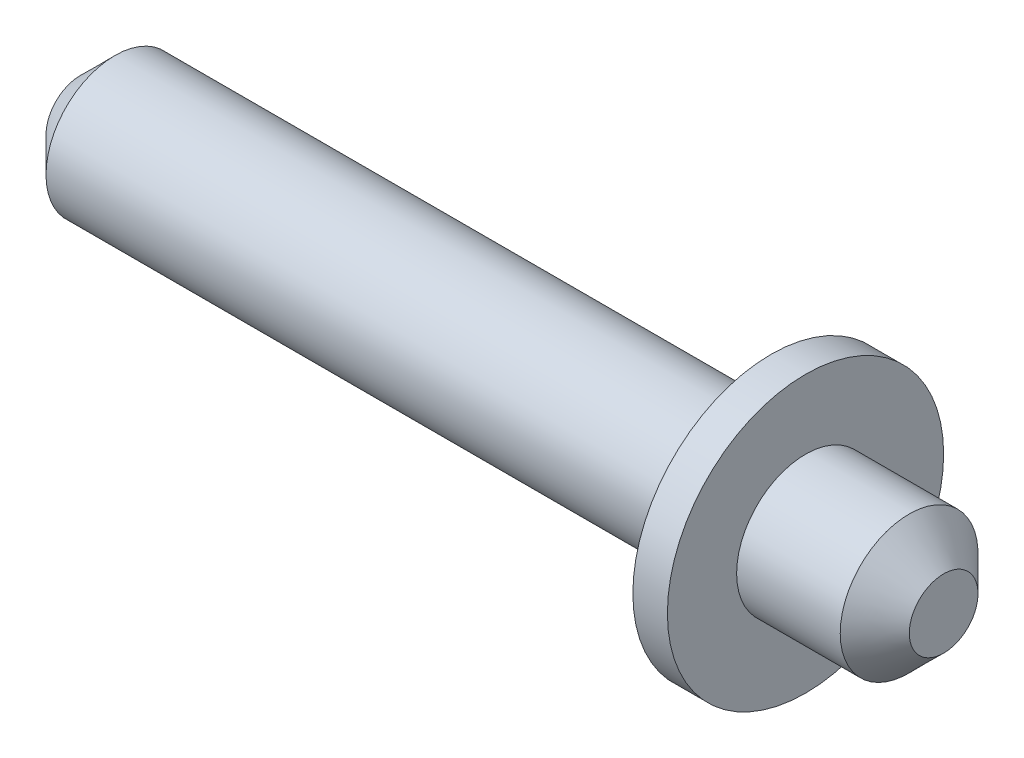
from build123d import *

# Parameters (mm, degrees)
CHAMFER1_SIZE = 1


with BuildPart() as part:
    # Sketch3 → Revolve1 (revolve)
    with BuildSketch(Plane.XY, mode=Mode.PRIVATE) as revolve1_sk:
        Polygon((0, 0), (0, 1.995), (20, 1.995), (20, 4), (21, 4), (21, 1.995), (25, 1.995), (25, 0), (21, 0), align=None)
    revolve(revolve1_sk.sketch.rotate(Axis((0, 0, 0), (1, 0, 0)), 90), axis=Axis((0, 0, 0), (1, 0, 0)))

    # Chamfer1
    chamfer1_edges = [part.edges().sort_by_distance(p)[0] for p in [
        (25, 0, -1.995),
        (0, 0, -1.995),
    ]]
    chamfer(chamfer1_edges, length=CHAMFER1_SIZE)


solid = part.part
